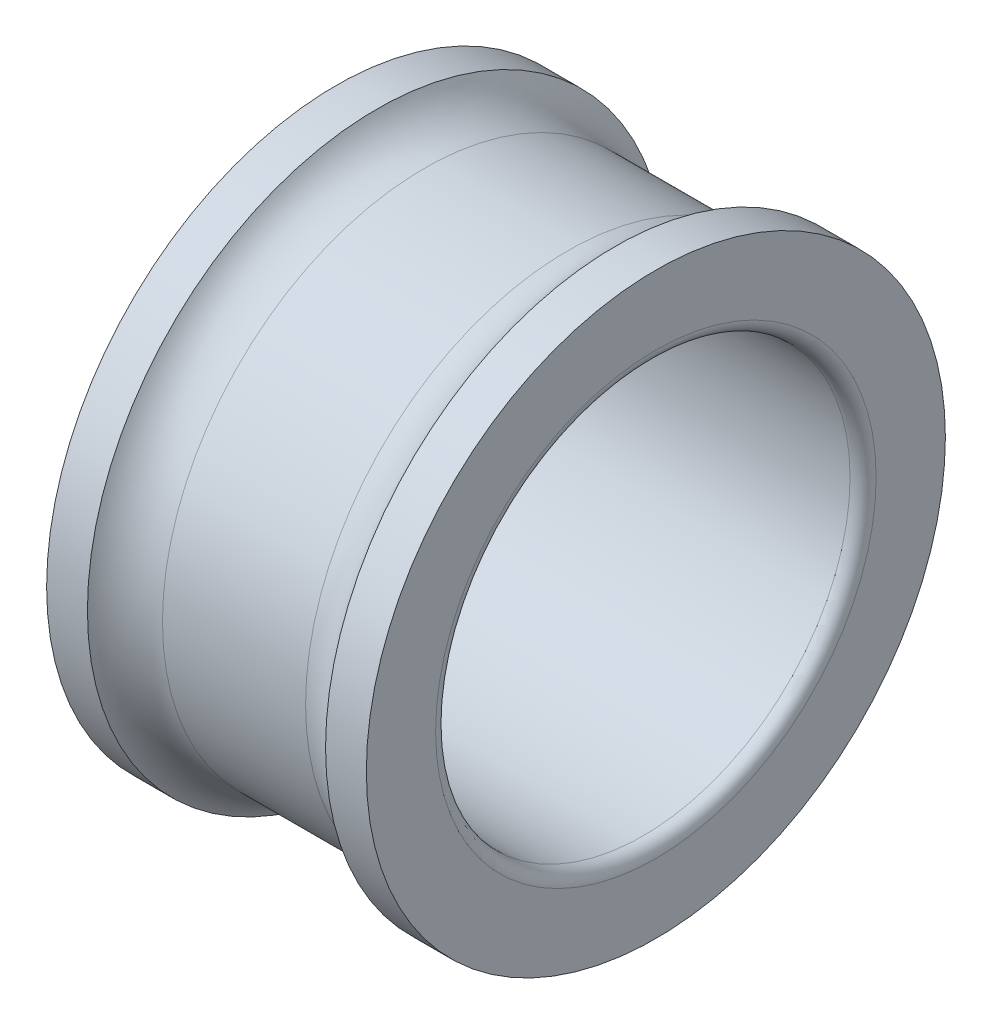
from build123d import *


with BuildPart() as part:
    # Esquisse1 → R_volution1 (revolve)
    with BuildSketch(Plane.XY, mode=Mode.PRIVATE) as r_volution1_sk:
        with BuildLine():
            Line((-12.4, 17.5), (12.4, 17.5))
            ThreePointArc((12.4, 17.5), (13.177817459, 17.822182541), (13.5, 18.6))
            Line((13.5, 18.6), (13.5, 24.45))
            Line((13.5, 24.45), (10.054225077, 24.45))
            ThreePointArc((10.054225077, 24.45), (8.360408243, 22.748242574), (6.041666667, 22.125))
            Line((6.041666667, 22.125), (-6.041666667, 22.125))
            ThreePointArc((-6.041666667, 22.125), (-8.360408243, 22.748242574), (-10.054225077, 24.45))
            Line((-10.054225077, 24.45), (-13.5, 24.45))
            Line((-13.5, 24.45), (-13.5, 18.6))
            ThreePointArc((-13.5, 18.6), (-13.177817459, 17.822182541), (-12.4, 17.5))
        make_face()
    revolve(r_volution1_sk.sketch.rotate(Axis((0, 0, 0), (1, 0, 0)), 90), axis=Axis((0, 0, 0), (1, 0, 0)))


solid = part.part
